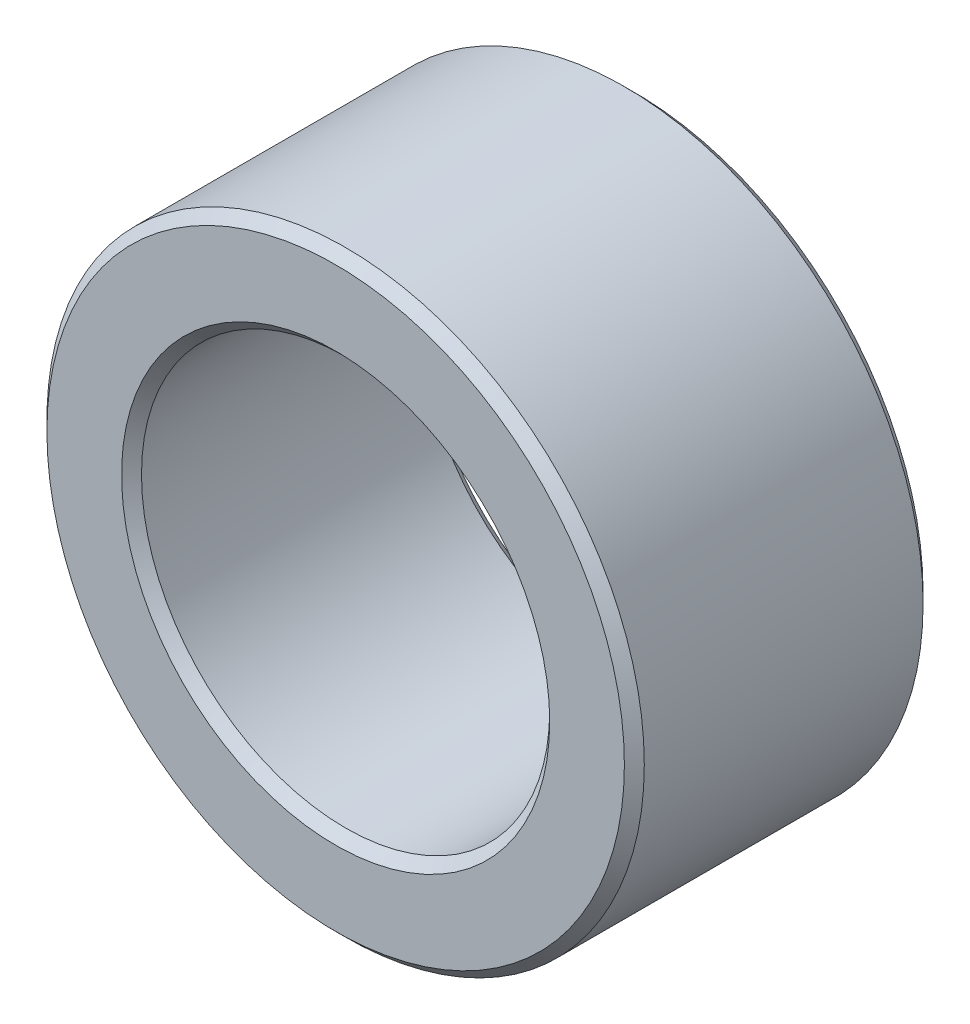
from build123d import *

# Parameters (mm, degrees)
SKETCH1_R           = 6
SKETCH1_R_2         = 4.1
BOSS_EXTRUDE2_DEPTH = 3
CHAMFER3_SIZE       = 0.2


with BuildPart() as part:
    # Sketch1 → Boss-Extrude2 (new, symmetric)
    with BuildSketch(Plane.XY):
        Circle(SKETCH1_R)
        Circle(SKETCH1_R_2, mode=Mode.SUBTRACT)
    extrude(amount=BOSS_EXTRUDE2_DEPTH, both=True)

    # Chamfer3
    chamfer3_edges = [part.edges().sort_by_distance(p)[0] for p in [
        (-6, 0, -3),
        (-6, 0, 3),
        (-4.1, 0, -3),
        (-4.1, 0, 3),
    ]]
    chamfer(chamfer3_edges, length=CHAMFER3_SIZE)


solid = part.part
